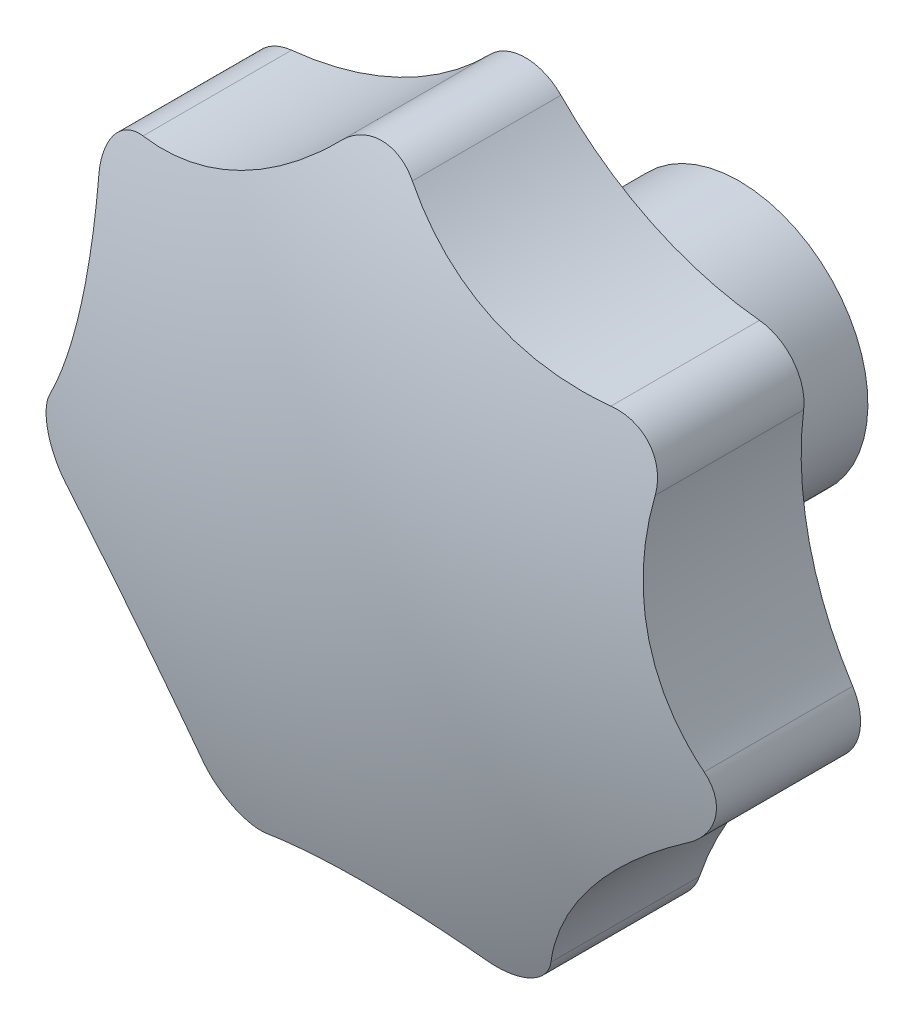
ISO-10303-21;
HEADER;
FILE_DESCRIPTION(('STEP AP214'),'2;1');
FILE_NAME('part.step','',(''),(''),'','','');
FILE_SCHEMA(('AUTOMOTIVE_DESIGN { 1 0 10303 214 1 1 1 1 }'));
ENDSEC;
DATA;
#1=APPLICATION_CONTEXT('core data for automotive mechanical design processes');
#2=APPLICATION_PROTOCOL_DEFINITION('international standard','automotive_design',2000,#1);
#3=PRODUCT_CONTEXT('',#1,'mechanical');
#4=PRODUCT('Part','Part','',(#3));
#5=PRODUCT_RELATED_PRODUCT_CATEGORY('part','',(#4));
#6=PRODUCT_DEFINITION_FORMATION('','',#4);
#7=PRODUCT_DEFINITION_CONTEXT('part definition',#1,'design');
#8=PRODUCT_DEFINITION('design','',#6,#7);
#9=PRODUCT_DEFINITION_SHAPE('','',#8);
#10=(LENGTH_UNIT() NAMED_UNIT(*) SI_UNIT(.MILLI.,.METRE.));
#11=(NAMED_UNIT(*) PLANE_ANGLE_UNIT() SI_UNIT($,.RADIAN.));
#12=(NAMED_UNIT(*) SI_UNIT($,.STERADIAN.) SOLID_ANGLE_UNIT());
#13=UNCERTAINTY_MEASURE_WITH_UNIT(LENGTH_MEASURE(1.E-05),#10,'distance_accuracy_value','');
#14=(GEOMETRIC_REPRESENTATION_CONTEXT(3) GLOBAL_UNCERTAINTY_ASSIGNED_CONTEXT((#13)) GLOBAL_UNIT_ASSIGNED_CONTEXT((#10,
#11,#12)) REPRESENTATION_CONTEXT('',''));
#15=CARTESIAN_POINT('',(0.,0.,0.));
#16=DIRECTION('',(0.,0.,1.));
#17=DIRECTION('',(1.,0.,0.));
#18=AXIS2_PLACEMENT_3D('',#15,#16,#17);
#19=CARTESIAN_POINT('',(0.,0.,-5.969));
#20=DIRECTION('',(0.,0.,-1.));
#21=DIRECTION('',(0.,1.,0.));
#22=AXIS2_PLACEMENT_3D('',#19,#20,#21);
#23=CYLINDRICAL_SURFACE('',#22,5.969);
#24=CARTESIAN_POINT('',(0.,0.,3.937));
#25=DIRECTION('',(0.,0.,-1.));
#26=DIRECTION('',(0.,1.,0.));
#27=AXIS2_PLACEMENT_3D('',#24,#25,#26);
#28=CIRCLE('',#27,5.969);
#29=CARTESIAN_POINT('',(0.,5.969,3.937));
#30=VERTEX_POINT('',#29);
#31=EDGE_CURVE('E353',#30,#30,#28,.T.);
#32=ORIENTED_EDGE('',*,*,#31,.T.);
#33=EDGE_LOOP('',(#32));
#34=FACE_BOUND('',#33,.T.);
#35=CARTESIAN_POINT('',(0.,0.,-5.969));
#36=DIRECTION('',(0.,0.,-1.));
#37=DIRECTION('',(0.,1.,0.));
#38=AXIS2_PLACEMENT_3D('',#35,#36,#37);
#39=CIRCLE('',#38,5.969);
#40=CARTESIAN_POINT('',(0.,5.969,-5.969));
#41=VERTEX_POINT('',#40);
#42=EDGE_CURVE('E12',#41,#41,#39,.T.);
#43=ORIENTED_EDGE('',*,*,#42,.F.);
#44=EDGE_LOOP('',(#43));
#45=FACE_BOUND('',#44,.T.);
#46=ADVANCED_FACE('F43',(#34,#45),#23,.T.);
#47=CARTESIAN_POINT('',(0.,5.969,-5.969));
#48=DIRECTION('',(0.,0.,-1.));
#49=DIRECTION('',(0.,1.,0.));
#50=AXIS2_PLACEMENT_3D('',#47,#48,#49);
#51=PLANE('',#50);
#52=ORIENTED_EDGE('',*,*,#42,.T.);
#53=EDGE_LOOP('',(#52));
#54=FACE_BOUND('',#53,.T.);
#55=CARTESIAN_POINT('',(0.,0.,-5.969));
#56=DIRECTION('',(0.,0.,-1.));
#57=DIRECTION('',(0.,1.,0.));
#58=AXIS2_PLACEMENT_3D('',#55,#56,#57);
#59=CIRCLE('',#58,3.8227);
#60=CARTESIAN_POINT('',(0.,3.8227,-5.969));
#61=VERTEX_POINT('',#60);
#62=EDGE_CURVE('E50',#61,#61,#59,.T.);
#63=ORIENTED_EDGE('',*,*,#62,.F.);
#64=EDGE_LOOP('',(#63));
#65=FACE_BOUND('',#64,.T.);
#66=ADVANCED_FACE('F364',(#54,#65),#51,.T.);
#67=CARTESIAN_POINT('',(0.,0.,-5.969));
#68=DIRECTION('',(0.,0.,-1.));
#69=DIRECTION('',(0.,1.,0.));
#70=AXIS2_PLACEMENT_3D('',#67,#68,#69);
#71=CYLINDRICAL_SURFACE('',#70,3.8227);
#72=ORIENTED_EDGE('',*,*,#62,.T.);
#73=EDGE_LOOP('',(#72));
#74=FACE_BOUND('',#73,.T.);
#75=CARTESIAN_POINT('',(0.,0.,6.604));
#76=DIRECTION('',(0.,0.,-1.));
#77=DIRECTION('',(0.,1.,0.));
#78=AXIS2_PLACEMENT_3D('',#75,#76,#77);
#79=CIRCLE('',#78,3.8227);
#80=CARTESIAN_POINT('',(0.,3.8227,6.604));
#81=VERTEX_POINT('',#80);
#82=EDGE_CURVE('E356',#81,#81,#79,.T.);
#83=ORIENTED_EDGE('',*,*,#82,.F.);
#84=EDGE_LOOP('',(#83));
#85=FACE_BOUND('',#84,.T.);
#86=ADVANCED_FACE('F361',(#74,#85),#71,.F.);
#87=CARTESIAN_POINT('',(0.,3.8227,6.604));
#88=DIRECTION('',(0.,0.,-1.));
#89=DIRECTION('',(0.,1.,0.));
#90=AXIS2_PLACEMENT_3D('',#87,#88,#89);
#91=PLANE('',#90);
#92=ORIENTED_EDGE('',*,*,#82,.T.);
#93=EDGE_LOOP('',(#92));
#94=FACE_BOUND('',#93,.T.);
#95=ADVANCED_FACE('F371',(#94),#91,.T.);
#96=CARTESIAN_POINT('',(0.,0.,-32.0639722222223));
#97=DIRECTION('',(0.,0.,-1.));
#98=DIRECTION('',(0.,1.,0.));
#99=AXIS2_PLACEMENT_3D('',#96,#97,#98);
#100=SPHERICAL_SURFACE('',#99,45.5259722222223);
#101=CARTESIAN_POINT('',(12.8945165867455,8.18465755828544,10.8237529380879));
#102=CARTESIAN_POINT('',(12.8729620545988,8.01142212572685,10.8632935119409));
#103=CARTESIAN_POINT('',(12.8543882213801,7.83740794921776,10.9009659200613));
#104=CARTESIAN_POINT('',(12.8233056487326,7.4880527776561,10.9725017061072));
#105=CARTESIAN_POINT('',(12.8107971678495,7.31271172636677,11.0063649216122));
#106=CARTESIAN_POINT('',(12.7825274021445,6.78506113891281,11.1021278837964));
#107=CARTESIAN_POINT('',(12.7760224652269,6.43112952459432,11.1581997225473));
#108=CARTESIAN_POINT('',(12.7882942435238,5.72168335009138,11.2542015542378));
#109=CARTESIAN_POINT('',(12.8070616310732,5.36616942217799,11.2941374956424));
#110=CARTESIAN_POINT('',(12.8701109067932,4.65596028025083,11.3575027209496));
#111=CARTESIAN_POINT('',(12.9143894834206,4.3012649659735,11.3809341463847));
#112=CARTESIAN_POINT('',(13.0284914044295,3.59452336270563,11.4110848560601));
#113=CARTESIAN_POINT('',(13.0983680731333,3.24248418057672,11.4177690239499));
#114=CARTESIAN_POINT('',(13.2632049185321,2.54441260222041,11.4142536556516));
#115=CARTESIAN_POINT('',(13.3581651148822,2.19838021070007,11.4040541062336));
#116=CARTESIAN_POINT('',(13.5722380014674,1.51526495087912,11.3669014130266));
#117=CARTESIAN_POINT('',(13.6913210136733,1.17817165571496,11.3399687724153));
#118=CARTESIAN_POINT('',(13.9525501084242,0.514957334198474,11.2696581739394));
#119=CARTESIAN_POINT('',(14.0946875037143,0.188832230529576,11.2262864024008));
#120=CARTESIAN_POINT('',(14.3846903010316,-0.417055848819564,11.1288943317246));
#121=CARTESIAN_POINT('',(14.5304107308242,-0.698105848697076,11.0764572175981));
#122=CARTESIAN_POINT('',(14.8378543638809,-1.24806248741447,10.9592450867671));
#123=CARTESIAN_POINT('',(14.9995526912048,-1.51698708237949,10.8944891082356));
#124=CARTESIAN_POINT('',(15.1687675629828,-1.7794311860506,10.8237446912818));
#125=B_SPLINE_CURVE_WITH_KNOTS('',3,(#101,#102,#103,#104,#105,#106,#107,#108,#109,#110,#111,
#112,#113,#114,#115,#116,#117,#118,#119,#120,#121,#122,#123,#124),.UNSPECIFIED.,.F.,.F.,(4,2,2,
2,2,2,2,2,2,2,2,4),(0.,0.536905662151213,1.07383420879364,2.14770785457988,3.22118525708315,
4.29452334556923,5.37011017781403,6.44569785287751,7.51997019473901,8.59383867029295,
9.55566318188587,10.5160131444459),.UNSPECIFIED.);
#126=CARTESIAN_POINT('',(12.8944917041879,8.18445755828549,10.8237985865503));
#127=VERTEX_POINT('',#126);
#128=CARTESIAN_POINT('',(15.1686386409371,-1.7792311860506,10.8237985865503));
#129=VERTEX_POINT('',#128);
#130=EDGE_CURVE('E151',#127,#129,#125,.T.);
#131=ORIENTED_EDGE('',*,*,#130,.F.);
#132=CARTESIAN_POINT('',(10.8483504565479,10.7500069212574,10.8238441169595));
#133=CARTESIAN_POINT('',(10.9104069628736,10.7437522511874,10.8097151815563));
#134=CARTESIAN_POINT('',(10.9723293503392,10.7349429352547,10.796116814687));
#135=CARTESIAN_POINT('',(11.0954952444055,10.7122387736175,10.7700814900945));
#136=CARTESIAN_POINT('',(11.1567386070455,10.6983428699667,10.7576447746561));
#137=CARTESIAN_POINT('',(11.2782672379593,10.6654492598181,10.7340083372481));
#138=CARTESIAN_POINT('',(11.3385496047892,10.646438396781,10.7228119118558));
#139=CARTESIAN_POINT('',(11.457528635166,10.6034252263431,10.7017929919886));
#140=CARTESIAN_POINT('',(11.5162254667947,10.5794234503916,10.6919703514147));
#141=CARTESIAN_POINT('',(11.6894939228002,10.4999917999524,10.664665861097));
#142=CARTESIAN_POINT('',(11.801129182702,10.4371664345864,10.6493697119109));
#143=CARTESIAN_POINT('',(12.0125215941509,10.2935818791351,10.6252777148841));
#144=CARTESIAN_POINT('',(12.1123141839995,10.2128783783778,10.616462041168));
#145=CARTESIAN_POINT('',(12.2416586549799,10.0890253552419,10.6088545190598));
#146=CARTESIAN_POINT('',(12.2774432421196,10.0523804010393,10.6072218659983));
#147=CARTESIAN_POINT('',(12.3465076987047,9.9767553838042,10.605043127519));
#148=CARTESIAN_POINT('',(12.3797869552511,9.93777475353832,10.6044973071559));
#149=CARTESIAN_POINT('',(12.4891771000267,9.80055764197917,10.6045065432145));
#150=CARTESIAN_POINT('',(12.5587931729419,9.69698898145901,10.6077362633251));
#151=CARTESIAN_POINT('',(12.6802800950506,9.48011252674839,10.6205407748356));
#152=CARTESIAN_POINT('',(12.7321174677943,9.36678685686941,10.6301274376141));
#153=CARTESIAN_POINT('',(12.8166362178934,9.13393353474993,10.6552825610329));
#154=CARTESIAN_POINT('',(12.8493304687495,9.01441010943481,10.6708469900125));
#155=CARTESIAN_POINT('',(12.8950074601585,8.77256069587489,10.7074032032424));
#156=CARTESIAN_POINT('',(12.9080106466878,8.65023774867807,10.7283893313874));
#157=CARTESIAN_POINT('',(12.9127671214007,8.47052138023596,10.7627522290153));
#158=CARTESIAN_POINT('',(12.9121075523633,8.41288110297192,10.774311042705));
#159=CARTESIAN_POINT('',(12.9064859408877,8.29813292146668,10.7983794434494));
#160=CARTESIAN_POINT('',(12.9015326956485,8.24102416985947,10.8108870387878));
#161=CARTESIAN_POINT('',(12.8944668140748,8.18425755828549,10.8238442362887));
#162=B_SPLINE_CURVE_WITH_KNOTS('',3,(#132,#133,#134,#135,#136,#137,#138,#139,#140,#141,#142,
#143,#144,#145,#146,#147,#148,#149,#150,#151,#152,#153,#154,#155,#156,#157,#158,#159,#160,#161),
.UNSPECIFIED.,.F.,.F.,(4,2,2,2,2,2,2,2,2,2,2,2,2,2,4),(0.,0.191803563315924,0.383647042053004,
0.57598877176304,0.768310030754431,1.15330932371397,1.5371258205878,1.69075801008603,
1.84442766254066,2.21693526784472,2.59014048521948,2.96309443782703,3.33566087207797,
3.51189425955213,3.68776741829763),.UNSPECIFIED.);
#163=CARTESIAN_POINT('',(10.8485504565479,10.7499867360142,10.8237985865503));
#164=VERTEX_POINT('',#163);
#165=EDGE_CURVE('E329',#164,#127,#162,.T.);
#166=ORIENTED_EDGE('',*,*,#165,.F.);
#167=CARTESIAN_POINT('',(1.64051749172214,15.1844500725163,10.823733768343));
#168=CARTESIAN_POINT('',(1.76251863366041,15.0595868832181,10.8632749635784));
#169=CARTESIAN_POINT('',(1.88698707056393,14.9365685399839,10.9009479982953));
#170=CARTESIAN_POINT('',(2.14074284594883,14.6944464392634,10.9724850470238));
#171=CARTESIAN_POINT('',(2.27003038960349,14.5753428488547,11.0063488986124));
#172=CARTESIAN_POINT('',(2.66493626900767,14.2242537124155,11.1021137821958));
#173=CARTESIAN_POINT('',(2.93759408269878,13.998493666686,11.1581869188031));
#174=CARTESIAN_POINT('',(3.49991031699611,13.5657524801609,11.2541913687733));
#175=CARTESIAN_POINT('',(3.78956242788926,13.3587644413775,11.2941286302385));
#176=CARTESIAN_POINT('',(4.38413475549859,12.9652467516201,11.3574965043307));
#177=CARTESIAN_POINT('',(4.68905298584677,12.7787144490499,11.380929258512));
#178=CARTESIAN_POINT('',(5.31274545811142,12.4272730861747,11.4110826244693));
#179=CARTESIAN_POINT('',(5.63154739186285,12.2624101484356,11.4177681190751));
#180=CARTESIAN_POINT('',(6.28009447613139,11.9560404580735,11.4142553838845));
#181=CARTESIAN_POINT('',(6.60983963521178,11.8145337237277,11.4040571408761));
#182=CARTESIAN_POINT('',(7.27739197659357,11.5559833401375,11.3669070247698));
#183=CARTESIAN_POINT('',(7.61518880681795,11.4389099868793,11.3399756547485));
#184=CARTESIAN_POINT('',(8.29658379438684,11.2296358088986,11.2696675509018));
#185=CARTESIAN_POINT('',(8.64017972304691,11.1374256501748,11.2262970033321));
#186=CARTESIAN_POINT('',(9.2947027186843,10.9863886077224,11.1289061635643));
#187=CARTESIAN_POINT('',(9.60529869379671,10.925082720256,11.0764687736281));
#188=CARTESIAN_POINT('',(10.2269742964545,10.8225546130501,10.9592554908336));
#189=CARTESIAN_POINT('',(10.5380524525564,10.7813017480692,10.8944986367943));
#190=CARTESIAN_POINT('',(10.8487504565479,10.7499665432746,10.8237530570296));
#191=B_SPLINE_CURVE_WITH_KNOTS('',3,(#167,#168,#169,#170,#171,#172,#173,#174,#175,#176,#177,
#178,#179,#180,#181,#182,#183,#184,#185,#186,#187,#188,#189,#190),.UNSPECIFIED.,.F.,.F.,(4,2,2,
2,2,2,2,2,2,2,2,4),(0.,0.53690592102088,1.07383472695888,2.14770889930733,3.2211868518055,
4.29452548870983,5.37011292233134,6.44570119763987,7.51997414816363,8.59384323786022,
9.55568990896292,10.516062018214),.UNSPECIFIED.);
#192=CARTESIAN_POINT('',(1.64071749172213,15.1842453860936,10.8237985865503));
#193=VERTEX_POINT('',#192);
#194=EDGE_CURVE('E64',#193,#164,#191,.T.);
#195=ORIENTED_EDGE('',*,*,#194,.F.);
#196=CARTESIAN_POINT('',(-1.64091749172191,15.1840406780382,10.823863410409));
#197=CARTESIAN_POINT('',(-1.59733736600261,15.2286603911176,10.8097339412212));
#198=CARTESIAN_POINT('',(-1.55184348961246,15.2715825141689,10.7961350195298));
#199=CARTESIAN_POINT('',(-1.45730283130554,15.3537253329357,10.7700985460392));
#200=CARTESIAN_POINT('',(-1.40825531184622,15.3929452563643,10.7576612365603));
#201=CARTESIAN_POINT('',(-1.30676862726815,15.4674552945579,10.7340235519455));
#202=CARTESIAN_POINT('',(-1.25432097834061,15.5027349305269,10.7228264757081));
#203=CARTESIAN_POINT('',(-1.14651169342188,15.5689424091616,10.7018062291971));
#204=CARTESIAN_POINT('',(-1.09115036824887,15.5998707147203,10.6919829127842));
#205=CARTESIAN_POINT('',(-0.921019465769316,15.6858191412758,10.6646763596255));
#206=CARTESIAN_POINT('',(-0.802298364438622,15.7339325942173,10.6493787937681));
#207=CARTESIAN_POINT('',(-0.55824015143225,15.809691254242,10.6252839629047));
#208=CARTESIAN_POINT('',(-0.432924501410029,15.8373989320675,10.6164668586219));
#209=CARTESIAN_POINT('',(-0.255509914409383,15.8613012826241,10.6088600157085));
#210=CARTESIAN_POINT('',(-0.204611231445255,15.8664286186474,10.6072281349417));
#211=CARTESIAN_POINT('',(-0.102550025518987,15.8732775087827,10.6050482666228));
#212=CARTESIAN_POINT('',(-0.0513874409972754,15.8749982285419,10.6045005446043));
#213=CARTESIAN_POINT('',(0.124119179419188,15.875004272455,10.604498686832));
#214=CARTESIAN_POINT('',(0.248584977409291,15.8648691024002,10.6077249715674));
#215=CARTESIAN_POINT('',(0.494064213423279,15.8246248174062,10.6205314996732));
#216=CARTESIAN_POINT('',(0.615070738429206,15.7944782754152,10.6301236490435));
#217=CARTESIAN_POINT('',(0.849898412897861,15.7153429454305,10.6552892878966));
#218=CARTESIAN_POINT('',(0.96372908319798,15.6663797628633,10.6708546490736));
#219=CARTESIAN_POINT('',(1.18129090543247,15.5512952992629,10.7074126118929));
#220=CARTESIAN_POINT('',(1.28503245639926,15.4851919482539,10.728399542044));
#221=CARTESIAN_POINT('',(1.42850683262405,15.3768531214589,10.7627644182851));
#222=CARTESIAN_POINT('',(1.47316308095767,15.3403952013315,10.7743245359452));
#223=CARTESIAN_POINT('',(1.55937628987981,15.2644470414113,10.7983956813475));
#224=CARTESIAN_POINT('',(1.60093939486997,15.2249631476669,10.8109047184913));
#225=CARTESIAN_POINT('',(1.64091749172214,15.1840406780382,10.823863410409));
#226=B_SPLINE_CURVE_WITH_KNOTS('',3,(#196,#197,#198,#199,#200,#201,#202,#203,#204,#205,#206,
#207,#208,#209,#210,#211,#212,#213,#214,#215,#216,#217,#218,#219,#220,#221,#222,#223,#224,#225),
.UNSPECIFIED.,.F.,.F.,(4,2,2,2,2,2,2,2,2,2,2,2,2,2,4),(0.,0.191804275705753,0.383648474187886,
0.575991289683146,0.768313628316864,1.15331515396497,1.5371330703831,1.69057745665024,
1.8440594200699,2.21682178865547,2.59028330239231,2.96323840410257,3.33580492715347,
3.51205241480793,3.68793989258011),.UNSPECIFIED.);
#227=CARTESIAN_POINT('',(-1.64071749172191,15.1842453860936,10.8237985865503));
#228=VERTEX_POINT('',#227);
#229=EDGE_CURVE('E57',#228,#193,#226,.T.);
#230=ORIENTED_EDGE('',*,*,#229,.F.);
#231=CARTESIAN_POINT('',(-10.8487504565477,10.7499665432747,10.8237530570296));
#232=CARTESIAN_POINT('',(-10.6750620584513,10.7675009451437,10.8632936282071));
#233=CARTESIAN_POINT('',(-10.5012777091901,10.7881146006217,10.900966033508));
#234=CARTESIAN_POINT('',(-10.1537650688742,10.835550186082,10.9725018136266));
#235=CARTESIAN_POINT('',(-9.98003678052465,10.8623723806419,11.0063650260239));
#236=CARTESIAN_POINT('',(-9.4593248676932,10.9522247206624,11.102127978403));
#237=CARTESIAN_POINT('',(-9.11281956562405,11.0246400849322,11.1581998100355));
#238=CARTESIAN_POINT('',(-8.42389142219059,11.1944708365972,11.2542016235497));
#239=CARTESIAN_POINT('',(-8.0814671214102,11.2918769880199,11.2941375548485));
#240=CARTESIAN_POINT('',(-7.40309421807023,11.5113819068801,11.3575027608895));
#241=CARTESIAN_POINT('',(-7.06714478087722,11.6334774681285,11.3809341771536));
#242=CARTESIAN_POINT('',(-6.40351275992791,11.9019834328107,11.4110848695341));
#243=CARTESIAN_POINT('',(-6.07584897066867,12.0484442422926,11.4177690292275));
#244=CARTESIAN_POINT('',(-5.4319591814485,12.364483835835,11.4142536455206));
#245=CARTESIAN_POINT('',(-5.1157331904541,12.5340626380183,11.4040540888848));
#246=CARTESIAN_POINT('',(-4.4973807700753,12.894775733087,11.3669013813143));
#247=CARTESIAN_POINT('',(-4.19523757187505,13.0858834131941,11.3399687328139));
#248=CARTESIAN_POINT('',(-3.6067803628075,13.4881420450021,11.2696581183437));
#249=CARTESIAN_POINT('',(-3.32046044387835,13.6992854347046,11.226286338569));
#250=CARTESIAN_POINT('',(-2.79428861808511,14.1168450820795,11.1288930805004));
#251=CARTESIAN_POINT('',(-2.55270501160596,14.3214569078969,11.0764544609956));
#252=CARTESIAN_POINT('',(-2.08493845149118,14.7435805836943,10.9592387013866));
#253=CARTESIAN_POINT('',(-1.85873245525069,14.9610721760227,10.8944806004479));
#254=CARTESIAN_POINT('',(-1.64051749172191,15.1844500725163,10.823733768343));
#255=B_SPLINE_CURVE_WITH_KNOTS('',3,(#231,#232,#233,#234,#235,#236,#237,#238,#239,#240,#241,
#242,#243,#244,#245,#246,#247,#248,#249,#250,#251,#252,#253,#254),.UNSPECIFIED.,.F.,.F.,(4,2,2,
2,2,2,2,2,2,2,2,4),(0.,0.536905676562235,1.07383423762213,2.1477079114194,3.22118527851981,
4.29452333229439,5.37011013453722,6.44569777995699,7.51997013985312,8.59383864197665,
9.55568762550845,10.5160620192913),.UNSPECIFIED.);
#256=CARTESIAN_POINT('',(-10.8485504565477,10.7499867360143,10.8237985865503));
#257=VERTEX_POINT('',#256);
#258=EDGE_CURVE('E161',#257,#228,#255,.T.);
#259=ORIENTED_EDGE('',*,*,#258,.F.);
#260=CARTESIAN_POINT('',(-12.8944668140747,8.18425755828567,10.8238442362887));
#261=CARTESIAN_POINT('',(-12.9021812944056,8.24623073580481,10.8096984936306));
#262=CARTESIAN_POINT('',(-12.9073766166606,8.30861312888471,10.7960886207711));
#263=CARTESIAN_POINT('',(-12.9126479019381,8.43384603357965,10.7700331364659));
#264=CARTESIAN_POINT('',(-12.9127229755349,8.49669662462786,10.7575877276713));
#265=CARTESIAN_POINT('',(-12.9051448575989,8.68535832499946,10.7221505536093));
#266=CARTESIAN_POINT('',(-12.8896925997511,8.81131336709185,10.7010500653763));
#267=CARTESIAN_POINT('',(-12.8379134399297,9.05989462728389,10.6646707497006));
#268=CARTESIAN_POINT('',(-12.8015540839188,9.18251535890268,10.6494010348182));
#269=CARTESIAN_POINT('',(-12.708686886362,9.4204882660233,10.625303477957));
#270=CARTESIAN_POINT('',(-12.6521935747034,9.5358456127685,10.6164710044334));
#271=CARTESIAN_POINT('',(-12.5223484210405,9.75278039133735,10.60573358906));
#272=CARTESIAN_POINT('',(-12.449490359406,9.85464480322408,10.6036488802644));
#273=CARTESIAN_POINT('',(-12.2882186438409,10.0451298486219,10.6059793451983));
#274=CARTESIAN_POINT('',(-12.1998050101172,10.1337504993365,10.6103945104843));
#275=CARTESIAN_POINT('',(-12.0114500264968,10.2940743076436,10.6254454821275));
#276=CARTESIAN_POINT('',(-11.9116916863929,10.366001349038,10.6359913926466));
#277=CARTESIAN_POINT('',(-11.7025394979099,10.4927726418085,10.6628528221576));
#278=CARTESIAN_POINT('',(-11.5931428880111,10.5476119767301,10.6791699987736));
#279=CARTESIAN_POINT('',(-11.3788337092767,10.6345575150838,10.715167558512));
#280=CARTESIAN_POINT('',(-11.2745261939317,10.6683605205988,10.7343640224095));
#281=CARTESIAN_POINT('',(-11.1159305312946,10.7075841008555,10.7659350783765));
#282=CARTESIAN_POINT('',(-11.0627229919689,10.7187437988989,10.7769184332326));
#283=CARTESIAN_POINT('',(-10.9558329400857,10.7372414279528,10.7997488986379));
#284=CARTESIAN_POINT('',(-10.9021504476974,10.7445795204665,10.8115959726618));
#285=CARTESIAN_POINT('',(-10.8483504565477,10.7500069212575,10.8238441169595));
#286=B_SPLINE_CURVE_WITH_KNOTS('',3,(#260,#261,#262,#263,#264,#265,#266,#267,#268,#269,#270,
#271,#272,#273,#274,#275,#276,#277,#278,#279,#280,#281,#282,#283,#284,#285),.UNSPECIFIED.,.F.,
.F.,(4,2,2,2,2,2,2,2,2,2,2,2,4),(0.,0.191993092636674,0.384019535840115,0.767968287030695,
1.15251465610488,1.5367840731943,1.91072810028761,2.28467164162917,2.65326556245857,
3.02196543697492,3.35466687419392,3.52093543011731,3.68719695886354),.UNSPECIFIED.);
#287=CARTESIAN_POINT('',(-12.8944917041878,8.18445755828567,10.8237985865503));
#288=VERTEX_POINT('',#287);
#289=EDGE_CURVE('E227',#288,#257,#286,.T.);
#290=ORIENTED_EDGE('',*,*,#289,.F.);
#291=CARTESIAN_POINT('',(-15.1687675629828,-1.77943118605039,10.8237446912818));
#292=CARTESIAN_POINT('',(-15.0741832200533,-1.63270386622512,10.8632855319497));
#293=CARTESIAN_POINT('',(-14.9819465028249,-1.48398163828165,10.9009582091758));
#294=CARTESIAN_POINT('',(-14.802361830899,-1.18271019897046,10.9724945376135));
#295=CARTESIAN_POINT('',(-14.7150140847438,-1.03016082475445,11.0063580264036));
#296=CARTESIAN_POINT('',(-14.4606037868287,-0.567030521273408,11.1021218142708));
#297=CARTESIAN_POINT('',(-14.3011771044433,-0.250971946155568,11.1581942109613));
#298=CARTESIAN_POINT('',(-14.0044148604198,0.393540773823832,11.2541971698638));
#299=CARTESIAN_POINT('',(-13.8670711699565,0.721990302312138,11.2941336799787));
#300=CARTESIAN_POINT('',(-13.6157267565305,1.38922213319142,11.3575000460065));
#301=CARTESIAN_POINT('',(-13.5017230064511,1.72800308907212,11.3809320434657));
#302=CARTESIAN_POINT('',(-13.2978798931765,2.41426186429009,11.4110838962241));
#303=CARTESIAN_POINT('',(-13.2080916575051,2.7617564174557,11.4177686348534));
#304=CARTESIAN_POINT('',(-13.0537208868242,3.46221701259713,11.4142543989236));
#305=CARTESIAN_POINT('',(-12.9891383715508,3.81518305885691,11.4040554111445));
#306=CARTESIAN_POINT('',(-12.8856170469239,4.52353136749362,11.3669038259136));
#307=CARTESIAN_POINT('',(-12.8466469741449,4.87891014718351,11.3399717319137));
#308=CARTESIAN_POINT('',(-12.7942466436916,5.58978881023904,11.2696622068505));
#309=CARTESIAN_POINT('',(-12.7808067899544,5.94528859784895,11.2262909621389));
#310=CARTESIAN_POINT('',(-12.7792037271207,6.61700229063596,11.1288999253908));
#311=CARTESIAN_POINT('',(-12.7885495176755,6.93344509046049,11.0764633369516));
#312=CARTESIAN_POINT('',(-12.8269278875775,7.56233331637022,10.9592522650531));
#313=CARTESIAN_POINT('',(-12.8559302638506,7.87478412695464,10.8944968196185));
#314=CARTESIAN_POINT('',(-12.8945165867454,8.18465755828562,10.8237529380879));
#315=B_SPLINE_CURVE_WITH_KNOTS('',3,(#291,#292,#293,#294,#295,#296,#297,#298,#299,#300,#301,
#302,#303,#304,#305,#306,#307,#308,#309,#310,#311,#312,#313,#314),.UNSPECIFIED.,.F.,.F.,(4,2,2,
2,2,2,2,2,2,2,2,4),(0.,0.536905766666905,1.07383441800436,2.14770827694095,3.22118592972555,
4.29452426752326,5.37011136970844,6.44569931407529,7.51997190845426,8.59384063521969,
9.55566415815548,10.5160131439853),.UNSPECIFIED.);
#316=CARTESIAN_POINT('',(-15.1686386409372,-1.77923118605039,10.8237985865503));
#317=VERTEX_POINT('',#316);
#318=EDGE_CURVE('E248',#317,#288,#315,.T.);
#319=ORIENTED_EDGE('',*,*,#318,.F.);
#320=CARTESIAN_POINT('',(-14.4382506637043,-4.97851619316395,10.8238517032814));
#321=CARTESIAN_POINT('',(-14.4915136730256,-4.94590870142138,10.8097057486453));
#322=CARTESIAN_POINT('',(-14.5435259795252,-4.91107648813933,10.7960956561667));
#323=CARTESIAN_POINT('',(-14.6447247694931,-4.83711766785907,10.7700397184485));
#324=CARTESIAN_POINT('',(-14.6939107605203,-4.79799031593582,10.7575940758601));
#325=CARTESIAN_POINT('',(-14.8366894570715,-4.67443874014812,10.7221561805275));
#326=CARTESIAN_POINT('',(-14.925532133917,-4.58382713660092,10.7010551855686));
#327=CARTESIAN_POINT('',(-15.087599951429,-4.38835869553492,10.664674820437));
#328=CARTESIAN_POINT('',(-15.1608005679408,-4.28347990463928,10.6494045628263));
#329=CARTESIAN_POINT('',(-15.2889567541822,-4.06250116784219,10.6253059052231));
#330=CARTESIAN_POINT('',(-15.3439254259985,-3.94640935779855,10.616472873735));
#331=CARTESIAN_POINT('',(-15.4325780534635,-3.70963657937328,10.6057343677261));
#332=CARTESIAN_POINT('',(-15.4667942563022,-3.58916274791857,10.6036491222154));
#333=CARTESIAN_POINT('',(-15.5151735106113,-3.34431029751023,10.6059785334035));
#334=CARTESIAN_POINT('',(-15.5293365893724,-3.21993168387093,10.6103931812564));
#335=CARTESIAN_POINT('',(-15.5372486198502,-2.9727094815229,10.6254431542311));
#336=CARTESIAN_POINT('',(-15.5312867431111,-2.84986939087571,10.6359885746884));
#337=CARTESIAN_POINT('',(-15.4999994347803,-2.60730652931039,10.6628490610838));
#338=CARTESIAN_POINT('',(-15.4746684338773,-2.4875846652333,10.6791657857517));
#339=CARTESIAN_POINT('',(-15.4090252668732,-2.26580964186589,10.7151642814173));
#340=CARTESIAN_POINT('',(-15.3704154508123,-2.16317214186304,10.7343625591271));
#341=CARTESIAN_POINT('',(-15.3021917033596,-2.01470652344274,10.7659369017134));
#342=CARTESIAN_POINT('',(-15.2777395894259,-1.96614439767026,10.7769214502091));
#343=CARTESIAN_POINT('',(-15.2255505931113,-1.87103207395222,10.7997544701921));
#344=CARTESIAN_POINT('',(-15.1978138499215,-1.82448179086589,10.8116029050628));
#345=CARTESIAN_POINT('',(-15.1685097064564,-1.77903118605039,10.823852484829));
#346=B_SPLINE_CURVE_WITH_KNOTS('',3,(#320,#321,#322,#323,#324,#325,#326,#327,#328,#329,#330,
#331,#332,#333,#334,#335,#336,#337,#338,#339,#340,#341,#342,#343,#344,#345),.UNSPECIFIED.,.F.,
.F.,(4,2,2,2,2,2,2,2,2,2,2,2,4),(0.,0.191993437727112,0.384020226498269,0.767969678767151,
1.15251675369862,1.53678687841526,1.91073136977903,2.28467535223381,2.65326921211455,
3.02196909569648,3.35470438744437,3.5209899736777,3.68726851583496),.UNSPECIFIED.);
#347=CARTESIAN_POINT('',(-14.4384506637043,-4.97839374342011,10.8237985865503));
#348=VERTEX_POINT('',#347);
#349=EDGE_CURVE('E253',#348,#317,#346,.T.);
#350=ORIENTED_EDGE('',*,*,#349,.F.);
#351=CARTESIAN_POINT('',(-8.06636515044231,-12.9688517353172,10.8237507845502));
#352=CARTESIAN_POINT('',(-8.1221091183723,-12.803419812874,10.8632914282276));
#353=CARTESIAN_POINT('',(-8.18087648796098,-12.6385795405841,10.9009639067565));
#354=CARTESIAN_POINT('',(-8.3044513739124,-12.3103351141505,10.9724998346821));
#355=CARTESIAN_POINT('',(-8.36925914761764,-12.1469310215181,11.0063631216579));
#356=CARTESIAN_POINT('',(-8.57272766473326,-11.6592683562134,11.1021262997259));
#357=CARTESIAN_POINT('',(-8.72043188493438,-11.3375645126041,11.1581982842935));
#358=CARTESIAN_POINT('',(-9.03930513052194,-10.7036999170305,11.2542004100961));
#359=CARTESIAN_POINT('',(-9.21046547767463,-10.3915356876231,11.2941364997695));
#360=CARTESIAN_POINT('',(-9.57541872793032,-9.77901517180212,11.3575020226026));
#361=CARTESIAN_POINT('',(-9.76920869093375,-9.47865735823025,11.380933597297));
#362=CARTESIAN_POINT('',(-10.17865430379,-8.89141185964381,11.4110846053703));
#363=CARTESIAN_POINT('',(-10.3943549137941,-8.60455371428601,11.4177689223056));
#364=CARTESIAN_POINT('',(-10.8457493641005,-8.04713266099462,11.4142538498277));
#365=CARTESIAN_POINT('',(-11.0814432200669,-7.77656976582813,11.4040544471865));
#366=CARTESIAN_POINT('',(-11.570708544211,-7.25398657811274,11.3669020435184));
#367=CARTESIAN_POINT('',(-11.8242577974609,-7.00194401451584,11.3399695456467));
#368=CARTESIAN_POINT('',(-12.3473747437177,-6.51775124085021,11.2696592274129));
#369=CARTESIAN_POINT('',(-12.6169363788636,-6.28559358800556,11.226287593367));
#370=CARTESIAN_POINT('',(-13.1411053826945,-5.86553384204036,11.1288956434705));
#371=CARTESIAN_POINT('',(-13.3943386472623,-5.67554156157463,11.076458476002));
#372=CARTESIAN_POINT('',(-13.9099544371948,-5.31344123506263,10.959246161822));
#373=CARTESIAN_POINT('',(-14.1723223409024,-5.14130621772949,10.8944900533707));
#374=CARTESIAN_POINT('',(-14.4386506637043,-4.97827128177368,10.8237454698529));
#375=B_SPLINE_CURVE_WITH_KNOTS('',3,(#351,#352,#353,#354,#355,#356,#357,#358,#359,#360,#361,
#362,#363,#364,#365,#366,#367,#368,#369,#370,#371,#372,#373,#374),.UNSPECIFIED.,.F.,.F.,(4,2,2,
2,2,2,2,2,2,2,2,4),(0.,0.536905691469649,1.07383426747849,2.14770797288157,3.2211854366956,
4.29452358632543,5.37011048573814,6.4456982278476,7.51997063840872,8.59383918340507,
9.55566654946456,10.5160193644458),.UNSPECIFIED.);
#376=CARTESIAN_POINT('',(-8.06643254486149,-12.9686517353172,10.8237985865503));
#377=VERTEX_POINT('',#376);
#378=EDGE_CURVE('E259',#377,#348,#375,.T.);
#379=ORIENTED_EDGE('',*,*,#378,.F.);
#380=CARTESIAN_POINT('',(-5.10976178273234,-14.3923404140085,10.8238467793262));
#381=CARTESIAN_POINT('',(-5.16846444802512,-14.4136521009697,10.8097009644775));
#382=CARTESIAN_POINT('',(-5.22812664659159,-14.4325988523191,10.7960910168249));
#383=CARTESIAN_POINT('',(-5.3490466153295,-14.4656055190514,10.7700353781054));
#384=CARTESIAN_POINT('',(-5.41030466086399,-14.4796645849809,10.7575898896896));
#385=CARTESIAN_POINT('',(-5.59592241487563,-14.5142585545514,10.7221524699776));
#386=CARTESIAN_POINT('',(-5.72215794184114,-14.5272219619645,10.7010518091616));
#387=CARTESIAN_POINT('',(-5.97602878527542,-14.53205675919,10.6646721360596));
#388=CARTESIAN_POINT('',(-6.10366597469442,-14.523895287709,10.6494022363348));
#389=CARTESIAN_POINT('',(-6.35633760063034,-14.4863115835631,10.6253043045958));
#390=CARTESIAN_POINT('',(-6.48137384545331,-14.4569046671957,10.6164716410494));
#391=CARTESIAN_POINT('',(-6.72176335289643,-14.3785886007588,10.6057338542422));
#392=CARTESIAN_POINT('',(-6.83728652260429,-14.3302247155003,10.6036489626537));
#393=CARTESIAN_POINT('',(-7.05888265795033,-14.2153842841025,10.605979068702));
#394=CARTESIAN_POINT('',(-7.16495563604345,-14.1489077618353,10.6103940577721));
#395=CARTESIAN_POINT('',(-7.36317343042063,-14.0009514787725,10.6254446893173));
#396=CARTESIAN_POINT('',(-7.45549579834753,-13.919699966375,10.6359904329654));
#397=CARTESIAN_POINT('',(-7.62563021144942,-13.7440016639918,10.66285154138));
#398=CARTESIAN_POINT('',(-7.70343807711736,-13.6495510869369,10.6791685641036));
#399=CARTESIAN_POINT('',(-7.83589478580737,-13.4599600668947,10.7151663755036));
#400=CARTESIAN_POINT('',(-7.89206283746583,-13.3657868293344,10.7343633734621));
#401=CARTESIAN_POINT('',(-7.9655961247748,-13.219891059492,10.765935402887));
#402=CARTESIAN_POINT('',(-7.98831646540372,-13.1704992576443,10.7769191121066));
#403=CARTESIAN_POINT('',(-8.03013666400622,-13.0704020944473,10.7997503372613));
#404=CARTESIAN_POINT('',(-8.04923667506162,-13.0196967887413,10.8115978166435));
#405=CARTESIAN_POINT('',(-8.06649993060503,-12.9684517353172,10.8238463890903));
#406=B_SPLINE_CURVE_WITH_KNOTS('',3,(#380,#381,#382,#383,#384,#385,#386,#387,#388,#389,#390,
#391,#392,#393,#394,#395,#396,#397,#398,#399,#400,#401,#402,#403,#404,#405),.UNSPECIFIED.,.F.,
.F.,(4,2,2,2,2,2,2,2,2,2,2,2,4),(0.,0.191993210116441,0.384019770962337,0.767968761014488,
1.15251537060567,1.53678502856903,1.9107292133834,2.28467290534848,2.6532668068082,
3.02196668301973,3.3546783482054,3.52095204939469,3.6872187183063),.UNSPECIFIED.);
#407=CARTESIAN_POINT('',(-5.10996178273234,-14.3924130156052,10.8237985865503));
#408=VERTEX_POINT('',#407);
#409=EDGE_CURVE('E286',#408,#377,#406,.T.);
#410=ORIENTED_EDGE('',*,*,#409,.F.);
#411=CARTESIAN_POINT('',(5.11016178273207,-14.3924856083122,10.823750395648));
#412=CARTESIAN_POINT('',(4.94606611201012,-14.3329228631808,10.8632910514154));
#413=CARTESIAN_POINT('',(4.78054795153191,-14.2760927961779,10.900963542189));
#414=CARTESIAN_POINT('',(4.44686846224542,-14.1680504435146,10.9724994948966));
#415=CARTESIAN_POINT('',(4.27870702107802,-14.1168383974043,11.0063627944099));
#416=CARTESIAN_POINT('',(3.77057647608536,-13.9718637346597,11.102126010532));
#417=CARTESIAN_POINT('',(3.42696622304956,-13.886764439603,11.1581980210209));
#418=CARTESIAN_POINT('',(2.7325767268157,-13.7408613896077,11.2542002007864));
#419=CARTESIAN_POINT('',(2.38180017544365,-13.680048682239,11.2941363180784));
#420=CARTESIAN_POINT('',(1.67536772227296,-13.5834802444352,11.3575018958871));
#421=CARTESIAN_POINT('',(1.31971245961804,-13.5477212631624,11.3809334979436));
#422=CARTESIAN_POINT('',(0.605300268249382,-13.5016970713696,11.4110845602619));
#423=CARTESIAN_POINT('',(0.246538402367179,-13.4914854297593,11.4177689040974));
#424=CARTESIAN_POINT('',(-0.47071077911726,-13.4968533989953,11.414253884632));
#425=CARTESIAN_POINT('',(-0.829198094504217,-13.5124330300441,11.4040545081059));
#426=CARTESIAN_POINT('',(-1.54282204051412,-13.569130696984,11.3669021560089));
#427=CARTESIAN_POINT('',(-1.89796223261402,-13.6102174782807,11.3399696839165));
#428=CARTESIAN_POINT('',(-2.60267748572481,-13.7173174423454,11.269659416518));
#429=CARTESIAN_POINT('',(-2.95225458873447,-13.7833212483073,11.2262878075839));
#430=CARTESIAN_POINT('',(-3.60748125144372,-13.9312292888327,11.1288963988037));
#431=CARTESIAN_POINT('',(-3.91390831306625,-14.0107557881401,11.0764598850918));
#432=CARTESIAN_POINT('',(-4.51848464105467,-14.1881122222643,10.9592491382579));
#433=CARTESIAN_POINT('',(-4.81664587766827,-14.2859139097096,10.8944939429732));
#434=CARTESIAN_POINT('',(-5.11016178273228,-14.3924856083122,10.823750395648));
#435=B_SPLINE_CURVE_WITH_KNOTS('',3,(#411,#412,#413,#414,#415,#416,#417,#418,#419,#420,#421,
#422,#423,#424,#425,#426,#427,#428,#429,#430,#431,#432,#433,#434),.UNSPECIFIED.,.F.,.F.,(4,2,2,
2,2,2,2,2,2,2,2,4),(0.,0.536905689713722,1.0738342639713,2.14770796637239,3.22118545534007,
4.29452362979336,5.37011055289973,6.44569831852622,7.5199707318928,8.59383927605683,
9.55565632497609,10.5159988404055),.UNSPECIFIED.);
#436=CARTESIAN_POINT('',(5.10996178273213,-14.3924130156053,10.8237985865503));
#437=VERTEX_POINT('',#436);
#438=EDGE_CURVE('E280',#437,#408,#435,.T.);
#439=ORIENTED_EDGE('',*,*,#438,.F.);
#440=CARTESIAN_POINT('',(8.06649993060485,-12.9684517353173,10.8238463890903));
#441=CARTESIAN_POINT('',(8.04656152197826,-13.0276349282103,10.809700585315));
#442=CARTESIAN_POINT('',(8.02417587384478,-13.0860937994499,10.7960906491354));
#443=CARTESIAN_POINT('',(7.97458907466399,-13.2012121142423,10.7700350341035));
#444=CARTESIAN_POINT('',(7.947387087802,-13.2578712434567,10.7575895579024));
#445=CARTESIAN_POINT('',(7.85870284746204,-13.4245619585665,10.722152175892));
#446=CARTESIAN_POINT('',(7.79013140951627,-13.5313393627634,10.7010515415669));
#447=CARTESIAN_POINT('',(7.63562538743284,-13.7328379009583,10.6646719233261));
#448=CARTESIAN_POINT('',(7.54966394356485,-13.8275400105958,10.6494020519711));
#449=CARTESIAN_POINT('',(7.36274152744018,-14.0016534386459,10.6253041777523));
#450=CARTESIAN_POINT('',(7.26179140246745,-14.081075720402,10.6164715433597));
#451=CARTESIAN_POINT('',(7.05068094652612,-14.2201903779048,10.605733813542));
#452=CARTESIAN_POINT('',(6.94084098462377,-14.2803555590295,10.6036489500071));
#453=CARTESIAN_POINT('',(6.71289213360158,-14.3820043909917,10.6059791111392));
#454=CARTESIAN_POINT('',(6.59478325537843,-14.4234880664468,10.610394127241));
#455=CARTESIAN_POINT('',(6.35551956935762,-14.4862115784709,10.6254448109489));
#456=CARTESIAN_POINT('',(6.23443251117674,-14.5077325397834,10.635990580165));
#457=CARTESIAN_POINT('',(5.99098896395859,-14.5312027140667,10.6628517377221));
#458=CARTESIAN_POINT('',(5.86863211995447,-14.5331462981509,10.6791687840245));
#459=CARTESIAN_POINT('',(5.63781846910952,-14.5184968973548,10.7151666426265));
#460=CARTESIAN_POINT('',(5.52917064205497,-14.5036947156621,10.7343636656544));
#461=CARTESIAN_POINT('',(5.36925746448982,-14.4702207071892,10.7659357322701));
#462=CARTESIAN_POINT('',(5.31647549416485,-14.4571888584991,10.7769194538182));
#463=CARTESIAN_POINT('',(5.21214190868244,-14.4274755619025,10.7997507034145));
#464=CARTESIAN_POINT('',(5.16059024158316,-14.4107942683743,10.8115981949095));
#465=CARTESIAN_POINT('',(5.10976178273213,-14.3923404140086,10.8238467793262));
#466=B_SPLINE_CURVE_WITH_KNOTS('',3,(#440,#441,#442,#443,#444,#445,#446,#447,#448,#449,#450,
#451,#452,#453,#454,#455,#456,#457,#458,#459,#460,#461,#462,#463,#464,#465),.UNSPECIFIED.,.F.,
.F.,(4,2,2,2,2,2,2,2,2,2,2,2,4),(0.,0.191993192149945,0.384019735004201,0.767968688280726,
1.15251526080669,1.53678488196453,1.91072904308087,2.28467271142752,2.65326661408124,
3.02196649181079,3.35467825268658,3.52095200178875,3.68721871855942),.UNSPECIFIED.);
#467=CARTESIAN_POINT('',(8.06643254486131,-12.9686517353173,10.8237985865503));
#468=VERTEX_POINT('',#467);
#469=EDGE_CURVE('E285',#468,#437,#466,.T.);
#470=ORIENTED_EDGE('',*,*,#469,.F.);
#471=CARTESIAN_POINT('',(14.4386506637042,-4.97827128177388,10.8237454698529));
#472=CARTESIAN_POINT('',(14.2897705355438,-5.06942945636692,10.8632862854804));
#473=CARTESIAN_POINT('',(14.1421399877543,-5.16340357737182,10.9009589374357));
#474=CARTESIAN_POINT('',(13.8496230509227,-5.35692096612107,10.9724952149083));
#475=CARTESIAN_POINT('',(13.7047367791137,-5.45646447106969,11.0063586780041));
#476=CARTESIAN_POINT('',(13.2745763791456,-5.76334606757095,11.1021223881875));
#477=CARTESIAN_POINT('',(12.9938052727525,-5.97893242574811,11.1581947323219));
#478=CARTESIAN_POINT('',(12.4467882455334,-6.43085813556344,11.2541975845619));
#479=CARTESIAN_POINT('',(12.1805370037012,-6.66718980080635,11.2941340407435));
#480=CARTESIAN_POINT('',(11.6645825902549,-7.15929076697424,11.3575002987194));
#481=CARTESIAN_POINT('',(11.4148772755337,-7.41505754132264,11.3809322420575));
#482=CARTESIAN_POINT('',(10.933464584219,-7.94491122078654,11.4110839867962));
#483=CARTESIAN_POINT('',(10.7017960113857,-8.21903538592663,11.4177686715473));
#484=CARTESIAN_POINT('',(10.2587944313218,-8.78314969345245,11.4142543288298));
#485=CARTESIAN_POINT('',(10.047461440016,-9.07313984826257,11.4040552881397));
#486=CARTESIAN_POINT('',(9.64685128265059,-9.66642347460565,11.3669035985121));
#487=CARTESIAN_POINT('',(9.45754746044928,-9.96970024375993,11.3399714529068));
#488=CARTESIAN_POINT('',(9.10189785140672,-10.5874441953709,11.269661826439));
#489=CARTESIAN_POINT('',(8.9355434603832,-10.9019071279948,11.2262905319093));
#490=CARTESIAN_POINT('',(8.64265318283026,-11.5064057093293,11.1288992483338));
#491=CARTESIAN_POINT('',(8.5137737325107,-11.7955668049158,11.0764624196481));
#492=CARTESIAN_POINT('',(8.27548654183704,-12.3788292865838,10.9592507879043));
#493=CARTESIAN_POINT('',(8.16604925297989,-12.6729224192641,10.894495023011));
#494=CARTESIAN_POINT('',(8.06636515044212,-12.9688517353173,10.8237507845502));
#495=B_SPLINE_CURVE_WITH_KNOTS('',3,(#471,#472,#473,#474,#475,#476,#477,#478,#479,#480,#481,
#482,#483,#484,#485,#486,#487,#488,#489,#490,#491,#492,#493,#494),.UNSPECIFIED.,.F.,.F.,(4,2,2,
2,2,2,2,2,2,2,2,4),(0.,0.536905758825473,1.07383440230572,2.14770824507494,3.22118587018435,
4.29452418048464,5.3701112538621,6.44569916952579,7.51997174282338,8.59384044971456,
9.55566717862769,10.5160193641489),.UNSPECIFIED.);
#496=CARTESIAN_POINT('',(14.4384506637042,-4.97839374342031,10.8237985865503));
#497=VERTEX_POINT('',#496);
#498=EDGE_CURVE('E295',#497,#468,#495,.T.);
#499=ORIENTED_EDGE('',*,*,#498,.F.);
#500=CARTESIAN_POINT('',(15.1685097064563,-1.7790311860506,10.823852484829));
#501=CARTESIAN_POINT('',(15.2023502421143,-1.83151942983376,10.8097065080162));
#502=CARTESIAN_POINT('',(15.2340986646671,-1.88546942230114,10.7960963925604));
#503=CARTESIAN_POINT('',(15.2931862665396,-1.99601245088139,10.7700404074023));
#504=CARTESIAN_POINT('',(15.3205246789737,-2.05260594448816,10.7575947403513));
#505=CARTESIAN_POINT('',(15.3955570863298,-2.22587133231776,10.7221567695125));
#506=CARTESIAN_POINT('',(15.4362868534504,-2.34605691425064,10.7010557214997));
#507=CARTESIAN_POINT('',(15.4974947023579,-2.59248642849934,10.6646752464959));
#508=CARTESIAN_POINT('',(15.5179411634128,-2.71873949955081,10.6494049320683));
#509=CARTESIAN_POINT('',(15.5375271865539,-2.97343935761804,10.6253061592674));
#510=CARTESIAN_POINT('',(15.5366820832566,-3.10188449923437,10.6164730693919));
#511=CARTESIAN_POINT('',(15.5138238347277,-3.35367440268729,10.605734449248));
#512=CARTESIAN_POINT('',(15.4923801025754,-3.47706347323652,10.6036491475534));
#513=CARTESIAN_POINT('',(15.4297311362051,-3.71865899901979,10.6059784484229));
#514=CARTESIAN_POINT('',(15.3885259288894,-3.83686546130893,10.6103930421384));
#515=CARTESIAN_POINT('',(15.2883890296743,-4.06303802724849,10.6254429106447));
#516=CARTESIAN_POINT('',(15.229719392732,-4.17112644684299,10.6359882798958));
#517=CARTESIAN_POINT('',(15.0962866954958,-4.3760931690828,10.6628486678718));
#518=CARTESIAN_POINT('',(15.0215190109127,-4.47296823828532,10.6791653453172));
#519=CARTESIAN_POINT('',(14.8661522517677,-4.64429930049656,10.7151637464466));
#520=CARTESIAN_POINT('',(14.7868334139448,-4.72002039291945,10.7343619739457));
#521=CARTESIAN_POINT('',(14.6609493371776,-4.82418224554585,10.7659362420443));
#522=CARTESIAN_POINT('',(14.6178484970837,-4.85732588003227,10.776920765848));
#523=CARTESIAN_POINT('',(14.529560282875,-4.92037526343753,10.7997537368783));
#524=CARTESIAN_POINT('',(14.4843729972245,-4.95028114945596,10.8116021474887));
#525=CARTESIAN_POINT('',(14.4382506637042,-4.97851619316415,10.8238517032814));
#526=B_SPLINE_CURVE_WITH_KNOTS('',3,(#500,#501,#502,#503,#504,#505,#506,#507,#508,#509,#510,
#511,#512,#513,#514,#515,#516,#517,#518,#519,#520,#521,#522,#523,#524,#525),.UNSPECIFIED.,.F.,
.F.,(4,2,2,2,2,2,2,2,2,2,2,2,4),(0.,0.191993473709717,0.384020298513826,0.76796982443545,
1.15251697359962,1.53678717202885,1.91073171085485,2.28467574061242,2.65326959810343,
3.0219694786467,3.35470457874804,3.52099006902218,3.6872685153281),.UNSPECIFIED.);
#527=EDGE_CURVE('E318',#129,#497,#526,.T.);
#528=ORIENTED_EDGE('',*,*,#527,.F.);
#529=EDGE_LOOP('',(#131,#166,#195,#230,#259,#290,#319,#350,#379,#410,#439,#470,#499,#528));
#530=FACE_BOUND('',#529,.T.);
#531=ADVANCED_FACE('F233',(#530),#100,.T.);
#532=CARTESIAN_POINT('',(0.,5.969,3.937));
#533=DIRECTION('',(0.,0.,-1.));
#534=DIRECTION('',(0.,1.,0.));
#535=AXIS2_PLACEMENT_3D('',#532,#533,#534);
#536=PLANE('',#535);
#537=CARTESIAN_POINT('',(10.618102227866,8.46765396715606,3.937));
#538=DIRECTION('',(0.,0.,1.));
#539=DIRECTION('',(-1.,0.,0.));
#540=AXIS2_PLACEMENT_3D('',#537,#538,#539);
#541=CIRCLE('',#540,2.2939375);
#542=CARTESIAN_POINT('',(12.8944917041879,8.18445755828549,3.937));
#543=VERTEX_POINT('',#542);
#544=CARTESIAN_POINT('',(10.8485504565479,10.7499867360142,3.937));
#545=VERTEX_POINT('',#544);
#546=EDGE_CURVE('E150',#543,#545,#541,.T.);
#547=ORIENTED_EDGE('',*,*,#546,.F.);
#548=CARTESIAN_POINT('',(27.7573371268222,6.33543106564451,3.937));
#549=DIRECTION('',(0.,0.,-1.));
#550=DIRECTION('',(-0.623489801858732,0.781831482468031,0.));
#551=AXIS2_PLACEMENT_3D('',#548,#549,#550);
#552=CIRCLE('',#551,14.9774187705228);
#553=CARTESIAN_POINT('',(15.1686386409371,-1.7792311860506,3.937));
#554=VERTEX_POINT('',#553);
#555=EDGE_CURVE('E212',#554,#543,#552,.T.);
#556=ORIENTED_EDGE('',*,*,#555,.F.);
#557=CARTESIAN_POINT('',(13.2405569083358,-3.02207071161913,3.937));
#558=DIRECTION('',(0.,0.,1.));
#559=DIRECTION('',(-0.623489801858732,0.781831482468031,0.));
#560=AXIS2_PLACEMENT_3D('',#557,#558,#559);
#561=CIRCLE('',#560,2.2939375);
#562=CARTESIAN_POINT('',(14.4384506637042,-4.97839374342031,3.937));
#563=VERTEX_POINT('',#562);
#564=EDGE_CURVE('E208',#563,#554,#561,.T.);
#565=ORIENTED_EDGE('',*,*,#564,.F.);
#566=CARTESIAN_POINT('',(22.2596560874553,-17.75148337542,3.937));
#567=DIRECTION('',(0.,0.,-1.));
#568=DIRECTION('',(0.222520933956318,0.974927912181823,0.));
#569=AXIS2_PLACEMENT_3D('',#566,#567,#568);
#570=CIRCLE('',#569,14.9774187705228);
#571=CARTESIAN_POINT('',(8.06643254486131,-12.9686517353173,3.937));
#572=VERTEX_POINT('',#571);
#573=EDGE_CURVE('E202',#572,#563,#570,.T.);
#574=ORIENTED_EDGE('',*,*,#573,.F.);
#575=CARTESIAN_POINT('',(5.89260217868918,-12.236114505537,3.937));
#576=DIRECTION('',(0.,0.,1.));
#577=DIRECTION('',(0.222520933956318,0.974927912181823,0.));
#578=AXIS2_PLACEMENT_3D('',#575,#576,#577);
#579=CIRCLE('',#578,2.2939375);
#580=CARTESIAN_POINT('',(5.10996178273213,-14.3924130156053,3.937));
#581=VERTEX_POINT('',#580);
#582=EDGE_CURVE('E198',#581,#572,#579,.T.);
#583=ORIENTED_EDGE('',*,*,#582,.F.);
#584=CARTESIAN_POINT('',(-2.04697370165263E-13,-28.4711687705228,3.937));
#585=DIRECTION('',(0.,0.,-1.));
#586=DIRECTION('',(0.900968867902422,0.433883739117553,0.));
#587=AXIS2_PLACEMENT_3D('',#584,#585,#586);
#588=CIRCLE('',#587,14.9774187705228);
#589=CARTESIAN_POINT('',(-5.10996178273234,-14.3924130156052,3.937));
#590=VERTEX_POINT('',#589);
#591=EDGE_CURVE('E192',#590,#581,#588,.T.);
#592=ORIENTED_EDGE('',*,*,#591,.F.);
#593=CARTESIAN_POINT('',(-5.89260217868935,-12.236114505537,3.937));
#594=DIRECTION('',(0.,0.,1.));
#595=DIRECTION('',(0.900968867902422,0.433883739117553,0.));
#596=AXIS2_PLACEMENT_3D('',#593,#594,#595);
#597=CIRCLE('',#596,2.2939375);
#598=CARTESIAN_POINT('',(-8.06643254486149,-12.9686517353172,3.937));
#599=VERTEX_POINT('',#598);
#600=EDGE_CURVE('E188',#599,#590,#597,.T.);
#601=ORIENTED_EDGE('',*,*,#600,.F.);
#602=CARTESIAN_POINT('',(-22.2596560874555,-17.7514833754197,3.937));
#603=DIRECTION('',(0.,0.,-1.));
#604=DIRECTION('',(0.900968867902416,-0.433883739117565,0.));
#605=AXIS2_PLACEMENT_3D('',#602,#603,#604);
#606=CIRCLE('',#605,14.9774187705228);
#607=CARTESIAN_POINT('',(-14.4384506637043,-4.97839374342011,3.937));
#608=VERTEX_POINT('',#607);
#609=EDGE_CURVE('E182',#608,#599,#606,.T.);
#610=ORIENTED_EDGE('',*,*,#609,.F.);
#611=CARTESIAN_POINT('',(-13.2405569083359,-3.02207071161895,3.937));
#612=DIRECTION('',(0.,0.,1.));
#613=DIRECTION('',(0.900968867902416,-0.433883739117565,0.));
#614=AXIS2_PLACEMENT_3D('',#611,#612,#613);
#615=CIRCLE('',#614,2.2939375);
#616=CARTESIAN_POINT('',(-15.1686386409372,-1.77923118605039,3.937));
#617=VERTEX_POINT('',#616);
#618=EDGE_CURVE('E178',#617,#608,#615,.T.);
#619=ORIENTED_EDGE('',*,*,#618,.F.);
#620=CARTESIAN_POINT('',(-27.7573371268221,6.33543106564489,3.937));
#621=DIRECTION('',(0.,0.,-1.));
#622=DIRECTION('',(0.222520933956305,-0.974927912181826,0.));
#623=AXIS2_PLACEMENT_3D('',#620,#621,#622);
#624=CIRCLE('',#623,14.9774187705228);
#625=CARTESIAN_POINT('',(-12.8944917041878,8.18445755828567,3.937));
#626=VERTEX_POINT('',#625);
#627=EDGE_CURVE('E172',#626,#617,#624,.T.);
#628=ORIENTED_EDGE('',*,*,#627,.F.);
#629=CARTESIAN_POINT('',(-10.6181022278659,8.4676539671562,3.937));
#630=DIRECTION('',(0.,0.,1.));
#631=DIRECTION('',(0.222520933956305,-0.974927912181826,0.));
#632=AXIS2_PLACEMENT_3D('',#629,#630,#631);
#633=CIRCLE('',#632,2.2939375);
#634=CARTESIAN_POINT('',(-10.8485504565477,10.7499867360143,3.937));
#635=VERTEX_POINT('',#634);
#636=EDGE_CURVE('E167',#635,#626,#633,.T.);
#637=ORIENTED_EDGE('',*,*,#636,.F.);
#638=CARTESIAN_POINT('',(-12.3531771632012,25.6516366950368,3.937));
#639=DIRECTION('',(0.,0.,-1.));
#640=DIRECTION('',(-0.623489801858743,-0.781831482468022,0.));
#641=AXIS2_PLACEMENT_3D('',#638,#639,#640);
#642=CIRCLE('',#641,14.9774187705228);
#643=CARTESIAN_POINT('',(-1.64071749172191,15.1842453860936,3.937));
#644=VERTEX_POINT('',#643);
#645=EDGE_CURVE('E158',#644,#635,#642,.T.);
#646=ORIENTED_EDGE('',*,*,#645,.F.);
#647=CARTESIAN_POINT('',(0.,13.5810625,3.937));
#648=DIRECTION('',(0.,0.,1.));
#649=DIRECTION('',(1.,0.,0.));
#650=AXIS2_PLACEMENT_3D('',#647,#648,#649);
#651=CIRCLE('',#650,2.2939375);
#652=CARTESIAN_POINT('',(1.64071749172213,15.1842453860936,3.937));
#653=VERTEX_POINT('',#652);
#654=EDGE_CURVE('E141',#653,#644,#651,.T.);
#655=ORIENTED_EDGE('',*,*,#654,.F.);
#656=CARTESIAN_POINT('',(12.3531771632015,25.6516366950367,3.937));
#657=DIRECTION('',(0.,0.,-1.));
#658=DIRECTION('',(-1.,0.,0.));
#659=AXIS2_PLACEMENT_3D('',#656,#657,#658);
#660=CIRCLE('',#659,14.9774187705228);
#661=EDGE_CURVE('E325',#545,#653,#660,.T.);
#662=ORIENTED_EDGE('',*,*,#661,.F.);
#663=EDGE_LOOP('',(#547,#556,#565,#574,#583,#592,#601,#610,#619,#628,#637,#646,#655,#662));
#664=FACE_BOUND('',#663,.T.);
#665=ORIENTED_EDGE('',*,*,#31,.F.);
#666=EDGE_LOOP('',(#665));
#667=FACE_BOUND('',#666,.T.);
#668=ADVANCED_FACE('F164',(#664,#667),#536,.T.);
#669=CARTESIAN_POINT('',(0.,13.5810625,13.462));
#670=DIRECTION('',(0.,0.,-1.));
#671=DIRECTION('',(-1.,0.,0.));
#672=AXIS2_PLACEMENT_3D('',#669,#670,#671);
#673=CYLINDRICAL_SURFACE('',#672,2.2939375);
#674=ORIENTED_EDGE('',*,*,#229,.T.);
#675=DIRECTION('',(0.,0.,-1.));
#676=VECTOR('',#675,1.);
#677=CARTESIAN_POINT('',(1.64071749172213,15.1842453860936,13.462));
#678=LINE('',#677,#676);
#679=EDGE_CURVE('E145',#193,#653,#678,.T.);
#680=ORIENTED_EDGE('',*,*,#679,.T.);
#681=ORIENTED_EDGE('',*,*,#654,.T.);
#682=DIRECTION('',(0.,0.,-1.));
#683=VECTOR('',#682,1.);
#684=CARTESIAN_POINT('',(-1.64071749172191,15.1842453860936,13.462));
#685=LINE('',#684,#683);
#686=EDGE_CURVE('E144',#228,#644,#685,.T.);
#687=ORIENTED_EDGE('',*,*,#686,.F.);
#688=EDGE_LOOP('',(#674,#680,#681,#687));
#689=FACE_BOUND('',#688,.T.);
#690=ADVANCED_FACE('F143',(#689),#673,.T.);
#691=CARTESIAN_POINT('',(12.3531771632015,25.6516366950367,13.462));
#692=DIRECTION('',(0.,0.,-1.));
#693=DIRECTION('',(-1.,0.,0.));
#694=AXIS2_PLACEMENT_3D('',#691,#692,#693);
#695=CYLINDRICAL_SURFACE('',#694,14.9774187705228);
#696=ORIENTED_EDGE('',*,*,#194,.T.);
#697=DIRECTION('',(0.,0.,-1.));
#698=VECTOR('',#697,1.);
#699=CARTESIAN_POINT('',(10.8485504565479,10.7499867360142,13.462));
#700=LINE('',#699,#698);
#701=EDGE_CURVE('E327',#164,#545,#700,.T.);
#702=ORIENTED_EDGE('',*,*,#701,.T.);
#703=ORIENTED_EDGE('',*,*,#661,.T.);
#704=ORIENTED_EDGE('',*,*,#679,.F.);
#705=EDGE_LOOP('',(#696,#702,#703,#704));
#706=FACE_BOUND('',#705,.T.);
#707=ADVANCED_FACE('F344',(#706),#695,.F.);
#708=CARTESIAN_POINT('',(10.618102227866,8.46765396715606,13.462));
#709=DIRECTION('',(0.,0.,-1.));
#710=DIRECTION('',(-1.,0.,0.));
#711=AXIS2_PLACEMENT_3D('',#708,#709,#710);
#712=CYLINDRICAL_SURFACE('',#711,2.2939375);
#713=ORIENTED_EDGE('',*,*,#165,.T.);
#714=DIRECTION('',(0.,0.,-1.));
#715=VECTOR('',#714,1.);
#716=CARTESIAN_POINT('',(12.8944917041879,8.18445755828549,13.462));
#717=LINE('',#716,#715);
#718=EDGE_CURVE('E216',#127,#543,#717,.T.);
#719=ORIENTED_EDGE('',*,*,#718,.T.);
#720=ORIENTED_EDGE('',*,*,#546,.T.);
#721=ORIENTED_EDGE('',*,*,#701,.F.);
#722=EDGE_LOOP('',(#713,#719,#720,#721));
#723=FACE_BOUND('',#722,.T.);
#724=ADVANCED_FACE('F340',(#723),#712,.T.);
#725=CARTESIAN_POINT('',(13.2405569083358,-3.02207071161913,13.462));
#726=DIRECTION('',(0.,0.,-1.));
#727=DIRECTION('',(-1.,0.,0.));
#728=AXIS2_PLACEMENT_3D('',#725,#726,#727);
#729=CYLINDRICAL_SURFACE('',#728,2.2939375);
#730=ORIENTED_EDGE('',*,*,#527,.T.);
#731=DIRECTION('',(0.,0.,-1.));
#732=VECTOR('',#731,1.);
#733=CARTESIAN_POINT('',(14.4384506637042,-4.97839374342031,13.462));
#734=LINE('',#733,#732);
#735=EDGE_CURVE('E206',#497,#563,#734,.T.);
#736=ORIENTED_EDGE('',*,*,#735,.T.);
#737=ORIENTED_EDGE('',*,*,#564,.T.);
#738=DIRECTION('',(0.,0.,-1.));
#739=VECTOR('',#738,1.);
#740=CARTESIAN_POINT('',(15.1686386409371,-1.7792311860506,13.462));
#741=LINE('',#740,#739);
#742=EDGE_CURVE('E215',#129,#554,#741,.T.);
#743=ORIENTED_EDGE('',*,*,#742,.F.);
#744=EDGE_LOOP('',(#730,#736,#737,#743));
#745=FACE_BOUND('',#744,.T.);
#746=ADVANCED_FACE('F304',(#745),#729,.T.);
#747=CARTESIAN_POINT('',(5.89260217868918,-12.236114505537,13.462));
#748=DIRECTION('',(0.,0.,-1.));
#749=DIRECTION('',(-1.,0.,0.));
#750=AXIS2_PLACEMENT_3D('',#747,#748,#749);
#751=CYLINDRICAL_SURFACE('',#750,2.2939375);
#752=ORIENTED_EDGE('',*,*,#469,.T.);
#753=DIRECTION('',(0.,0.,-1.));
#754=VECTOR('',#753,1.);
#755=CARTESIAN_POINT('',(5.10996178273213,-14.3924130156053,13.462));
#756=LINE('',#755,#754);
#757=EDGE_CURVE('E196',#437,#581,#756,.T.);
#758=ORIENTED_EDGE('',*,*,#757,.T.);
#759=ORIENTED_EDGE('',*,*,#582,.T.);
#760=DIRECTION('',(0.,0.,-1.));
#761=VECTOR('',#760,1.);
#762=CARTESIAN_POINT('',(8.06643254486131,-12.9686517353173,13.462));
#763=LINE('',#762,#761);
#764=EDGE_CURVE('E205',#468,#572,#763,.T.);
#765=ORIENTED_EDGE('',*,*,#764,.F.);
#766=EDGE_LOOP('',(#752,#758,#759,#765));
#767=FACE_BOUND('',#766,.T.);
#768=ADVANCED_FACE('F300',(#767),#751,.T.);
#769=CARTESIAN_POINT('',(-5.89260217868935,-12.236114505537,13.462));
#770=DIRECTION('',(0.,0.,-1.));
#771=DIRECTION('',(-1.,0.,0.));
#772=AXIS2_PLACEMENT_3D('',#769,#770,#771);
#773=CYLINDRICAL_SURFACE('',#772,2.2939375);
#774=ORIENTED_EDGE('',*,*,#409,.T.);
#775=DIRECTION('',(0.,0.,-1.));
#776=VECTOR('',#775,1.);
#777=CARTESIAN_POINT('',(-8.06643254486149,-12.9686517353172,13.462));
#778=LINE('',#777,#776);
#779=EDGE_CURVE('E186',#377,#599,#778,.T.);
#780=ORIENTED_EDGE('',*,*,#779,.T.);
#781=ORIENTED_EDGE('',*,*,#600,.T.);
#782=DIRECTION('',(0.,0.,-1.));
#783=VECTOR('',#782,1.);
#784=CARTESIAN_POINT('',(-5.10996178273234,-14.3924130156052,13.462));
#785=LINE('',#784,#783);
#786=EDGE_CURVE('E195',#408,#590,#785,.T.);
#787=ORIENTED_EDGE('',*,*,#786,.F.);
#788=EDGE_LOOP('',(#774,#780,#781,#787));
#789=FACE_BOUND('',#788,.T.);
#790=ADVANCED_FACE('F268',(#789),#773,.T.);
#791=CARTESIAN_POINT('',(-13.2405569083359,-3.02207071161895,13.462));
#792=DIRECTION('',(0.,0.,-1.));
#793=DIRECTION('',(-1.,0.,0.));
#794=AXIS2_PLACEMENT_3D('',#791,#792,#793);
#795=CYLINDRICAL_SURFACE('',#794,2.2939375);
#796=ORIENTED_EDGE('',*,*,#349,.T.);
#797=DIRECTION('',(0.,0.,-1.));
#798=VECTOR('',#797,1.);
#799=CARTESIAN_POINT('',(-15.1686386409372,-1.77923118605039,13.462));
#800=LINE('',#799,#798);
#801=EDGE_CURVE('E176',#317,#617,#800,.T.);
#802=ORIENTED_EDGE('',*,*,#801,.T.);
#803=ORIENTED_EDGE('',*,*,#618,.T.);
#804=DIRECTION('',(0.,0.,-1.));
#805=VECTOR('',#804,1.);
#806=CARTESIAN_POINT('',(-14.4384506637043,-4.97839374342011,13.462));
#807=LINE('',#806,#805);
#808=EDGE_CURVE('E185',#348,#608,#807,.T.);
#809=ORIENTED_EDGE('',*,*,#808,.F.);
#810=EDGE_LOOP('',(#796,#802,#803,#809));
#811=FACE_BOUND('',#810,.T.);
#812=ADVANCED_FACE('F264',(#811),#795,.T.);
#813=CARTESIAN_POINT('',(-10.6181022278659,8.4676539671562,13.462));
#814=DIRECTION('',(0.,0.,-1.));
#815=DIRECTION('',(-1.,0.,0.));
#816=AXIS2_PLACEMENT_3D('',#813,#814,#815);
#817=CYLINDRICAL_SURFACE('',#816,2.2939375);
#818=ORIENTED_EDGE('',*,*,#289,.T.);
#819=DIRECTION('',(0.,0.,-1.));
#820=VECTOR('',#819,1.);
#821=CARTESIAN_POINT('',(-10.8485504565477,10.7499867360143,13.462));
#822=LINE('',#821,#820);
#823=EDGE_CURVE('E162',#257,#635,#822,.T.);
#824=ORIENTED_EDGE('',*,*,#823,.T.);
#825=ORIENTED_EDGE('',*,*,#636,.T.);
#826=DIRECTION('',(0.,0.,-1.));
#827=VECTOR('',#826,1.);
#828=CARTESIAN_POINT('',(-12.8944917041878,8.18445755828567,13.462));
#829=LINE('',#828,#827);
#830=EDGE_CURVE('E175',#288,#626,#829,.T.);
#831=ORIENTED_EDGE('',*,*,#830,.F.);
#832=EDGE_LOOP('',(#818,#824,#825,#831));
#833=FACE_BOUND('',#832,.T.);
#834=ADVANCED_FACE('F245',(#833),#817,.T.);
#835=CARTESIAN_POINT('',(27.7573371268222,6.33543106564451,13.462));
#836=DIRECTION('',(0.,0.,-1.));
#837=DIRECTION('',(-1.,0.,0.));
#838=AXIS2_PLACEMENT_3D('',#835,#836,#837);
#839=CYLINDRICAL_SURFACE('',#838,14.9774187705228);
#840=ORIENTED_EDGE('',*,*,#130,.T.);
#841=ORIENTED_EDGE('',*,*,#742,.T.);
#842=ORIENTED_EDGE('',*,*,#555,.T.);
#843=ORIENTED_EDGE('',*,*,#718,.F.);
#844=EDGE_LOOP('',(#840,#841,#842,#843));
#845=FACE_BOUND('',#844,.T.);
#846=ADVANCED_FACE('F307',(#845),#839,.F.);
#847=CARTESIAN_POINT('',(22.2596560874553,-17.75148337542,13.462));
#848=DIRECTION('',(0.,0.,-1.));
#849=DIRECTION('',(-1.,0.,0.));
#850=AXIS2_PLACEMENT_3D('',#847,#848,#849);
#851=CYLINDRICAL_SURFACE('',#850,14.9774187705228);
#852=ORIENTED_EDGE('',*,*,#498,.T.);
#853=ORIENTED_EDGE('',*,*,#764,.T.);
#854=ORIENTED_EDGE('',*,*,#573,.T.);
#855=ORIENTED_EDGE('',*,*,#735,.F.);
#856=EDGE_LOOP('',(#852,#853,#854,#855));
#857=FACE_BOUND('',#856,.T.);
#858=ADVANCED_FACE('F275',(#857),#851,.F.);
#859=CARTESIAN_POINT('',(-2.04697370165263E-13,-28.4711687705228,13.462));
#860=DIRECTION('',(0.,0.,-1.));
#861=DIRECTION('',(-1.,0.,0.));
#862=AXIS2_PLACEMENT_3D('',#859,#860,#861);
#863=CYLINDRICAL_SURFACE('',#862,14.9774187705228);
#864=ORIENTED_EDGE('',*,*,#438,.T.);
#865=ORIENTED_EDGE('',*,*,#786,.T.);
#866=ORIENTED_EDGE('',*,*,#591,.T.);
#867=ORIENTED_EDGE('',*,*,#757,.F.);
#868=EDGE_LOOP('',(#864,#865,#866,#867));
#869=FACE_BOUND('',#868,.T.);
#870=ADVANCED_FACE('F271',(#869),#863,.F.);
#871=CARTESIAN_POINT('',(-22.2596560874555,-17.7514833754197,13.462));
#872=DIRECTION('',(0.,0.,-1.));
#873=DIRECTION('',(-1.,0.,0.));
#874=AXIS2_PLACEMENT_3D('',#871,#872,#873);
#875=CYLINDRICAL_SURFACE('',#874,14.9774187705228);
#876=ORIENTED_EDGE('',*,*,#378,.T.);
#877=ORIENTED_EDGE('',*,*,#808,.T.);
#878=ORIENTED_EDGE('',*,*,#609,.T.);
#879=ORIENTED_EDGE('',*,*,#779,.F.);
#880=EDGE_LOOP('',(#876,#877,#878,#879));
#881=FACE_BOUND('',#880,.T.);
#882=ADVANCED_FACE('F243',(#881),#875,.F.);
#883=CARTESIAN_POINT('',(-27.7573371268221,6.33543106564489,13.462));
#884=DIRECTION('',(0.,0.,-1.));
#885=DIRECTION('',(-1.,0.,0.));
#886=AXIS2_PLACEMENT_3D('',#883,#884,#885);
#887=CYLINDRICAL_SURFACE('',#886,14.9774187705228);
#888=ORIENTED_EDGE('',*,*,#318,.T.);
#889=ORIENTED_EDGE('',*,*,#830,.T.);
#890=ORIENTED_EDGE('',*,*,#627,.T.);
#891=ORIENTED_EDGE('',*,*,#801,.F.);
#892=EDGE_LOOP('',(#888,#889,#890,#891));
#893=FACE_BOUND('',#892,.T.);
#894=ADVANCED_FACE('F240',(#893),#887,.F.);
#895=CARTESIAN_POINT('',(-12.3531771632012,25.6516366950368,13.462));
#896=DIRECTION('',(0.,0.,-1.));
#897=DIRECTION('',(-1.,0.,0.));
#898=AXIS2_PLACEMENT_3D('',#895,#896,#897);
#899=CYLINDRICAL_SURFACE('',#898,14.9774187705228);
#900=ORIENTED_EDGE('',*,*,#258,.T.);
#901=ORIENTED_EDGE('',*,*,#686,.T.);
#902=ORIENTED_EDGE('',*,*,#645,.T.);
#903=ORIENTED_EDGE('',*,*,#823,.F.);
#904=EDGE_LOOP('',(#900,#901,#902,#903));
#905=FACE_BOUND('',#904,.T.);
#906=ADVANCED_FACE('F156',(#905),#899,.F.);
#907=CLOSED_SHELL('',(#46,#66,#86,#95,#531,#668,#690,#707,#724,#746,#768,#790,#812,#834,#846,
#858,#870,#882,#894,#906));
#908=MANIFOLD_SOLID_BREP('B2',#907);
#909=CARTESIAN_POINT('',(0.,0.,-5.969));
#910=DIRECTION('',(0.,0.,-1.));
#911=DIRECTION('',(0.,1.,0.));
#912=AXIS2_PLACEMENT_3D('',#909,#910,#911);
#913=PLANE('',#912);
#914=CARTESIAN_POINT('',(0.,0.,-5.969));
#915=DIRECTION('',(0.,0.,-1.));
#916=DIRECTION('',(0.,1.,0.));
#917=AXIS2_PLACEMENT_3D('',#914,#915,#916);
#918=CIRCLE('',#917,3.8227);
#919=CARTESIAN_POINT('',(0.,3.8227,-5.969));
#920=VERTEX_POINT('',#919);
#921=EDGE_CURVE('E585',#920,#920,#918,.T.);
#922=ORIENTED_EDGE('',*,*,#921,.T.);
#923=EDGE_LOOP('',(#922));
#924=FACE_BOUND('',#923,.T.);
#925=CARTESIAN_POINT('',(0.,0.,-5.969));
#926=DIRECTION('',(0.,0.,1.));
#927=DIRECTION('',(0.,-1.,0.));
#928=AXIS2_PLACEMENT_3D('',#925,#926,#927);
#929=CIRCLE('',#928,3.1877);
#930=CARTESIAN_POINT('',(0.,-3.18770000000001,-5.969));
#931=VERTEX_POINT('',#930);
#932=EDGE_CURVE('E593',#931,#931,#929,.T.);
#933=ORIENTED_EDGE('',*,*,#932,.T.);
#934=EDGE_LOOP('',(#933));
#935=FACE_BOUND('',#934,.T.);
#936=ADVANCED_FACE('F578',(#924,#935),#913,.T.);
#937=CARTESIAN_POINT('',(0.,3.8227,6.604));
#938=DIRECTION('',(0.,0.,1.));
#939=DIRECTION('',(0.,-1.,0.));
#940=AXIS2_PLACEMENT_3D('',#937,#938,#939);
#941=PLANE('',#940);
#942=CARTESIAN_POINT('',(0.,0.,6.604));
#943=DIRECTION('',(0.,0.,-1.));
#944=DIRECTION('',(0.,1.,0.));
#945=AXIS2_PLACEMENT_3D('',#942,#943,#944);
#946=CIRCLE('',#945,3.8227);
#947=CARTESIAN_POINT('',(0.,3.8227,6.604));
#948=VERTEX_POINT('',#947);
#949=EDGE_CURVE('E42',#948,#948,#946,.T.);
#950=ORIENTED_EDGE('',*,*,#949,.F.);
#951=EDGE_LOOP('',(#950));
#952=FACE_BOUND('',#951,.T.);
#953=ADVANCED_FACE('F580',(#952),#941,.T.);
#954=CARTESIAN_POINT('',(0.,0.,-5.969));
#955=DIRECTION('',(0.,0.,-1.));
#956=DIRECTION('',(0.,1.,0.));
#957=AXIS2_PLACEMENT_3D('',#954,#955,#956);
#958=CYLINDRICAL_SURFACE('',#957,3.8227);
#959=ORIENTED_EDGE('',*,*,#949,.T.);
#960=EDGE_LOOP('',(#959));
#961=FACE_BOUND('',#960,.T.);
#962=ORIENTED_EDGE('',*,*,#921,.F.);
#963=EDGE_LOOP('',(#962));
#964=FACE_BOUND('',#963,.T.);
#965=ADVANCED_FACE('F608',(#961,#964),#958,.T.);
#966=CARTESIAN_POINT('',(0.,0.,5.969));
#967=DIRECTION('',(0.,0.,-1.));
#968=DIRECTION('',(0.,1.,0.));
#969=AXIS2_PLACEMENT_3D('',#966,#967,#968);
#970=PLANE('',#969);
#971=CARTESIAN_POINT('',(0.,0.,5.969));
#972=DIRECTION('',(0.,0.,1.));
#973=DIRECTION('',(0.,-1.,0.));
#974=AXIS2_PLACEMENT_3D('',#971,#972,#973);
#975=CIRCLE('',#974,3.1877);
#976=CARTESIAN_POINT('',(0.,-3.18770000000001,5.969));
#977=VERTEX_POINT('',#976);
#978=EDGE_CURVE('E589',#977,#977,#975,.T.);
#979=ORIENTED_EDGE('',*,*,#978,.F.);
#980=EDGE_LOOP('',(#979));
#981=FACE_BOUND('',#980,.T.);
#982=ADVANCED_FACE('F602',(#981),#970,.T.);
#983=CARTESIAN_POINT('',(0.,0.,8.5598));
#984=DIRECTION('',(0.,0.,1.));
#985=DIRECTION('',(0.,-1.,0.));
#986=AXIS2_PLACEMENT_3D('',#983,#984,#985);
#987=CYLINDRICAL_SURFACE('',#986,3.1877);
#988=ORIENTED_EDGE('',*,*,#978,.T.);
#989=EDGE_LOOP('',(#988));
#990=FACE_BOUND('',#989,.T.);
#991=ORIENTED_EDGE('',*,*,#932,.F.);
#992=EDGE_LOOP('',(#991));
#993=FACE_BOUND('',#992,.T.);
#994=ADVANCED_FACE('F600',(#990,#993),#987,.F.);
#995=CLOSED_SHELL('',(#936,#953,#965,#982,#994));
#996=MANIFOLD_SOLID_BREP('B6',#995);
#997=ADVANCED_BREP_SHAPE_REPRESENTATION('',(#18,#908,#996),#14);
#998=SHAPE_DEFINITION_REPRESENTATION(#9,#997);
ENDSEC;
END-ISO-10303-21;
